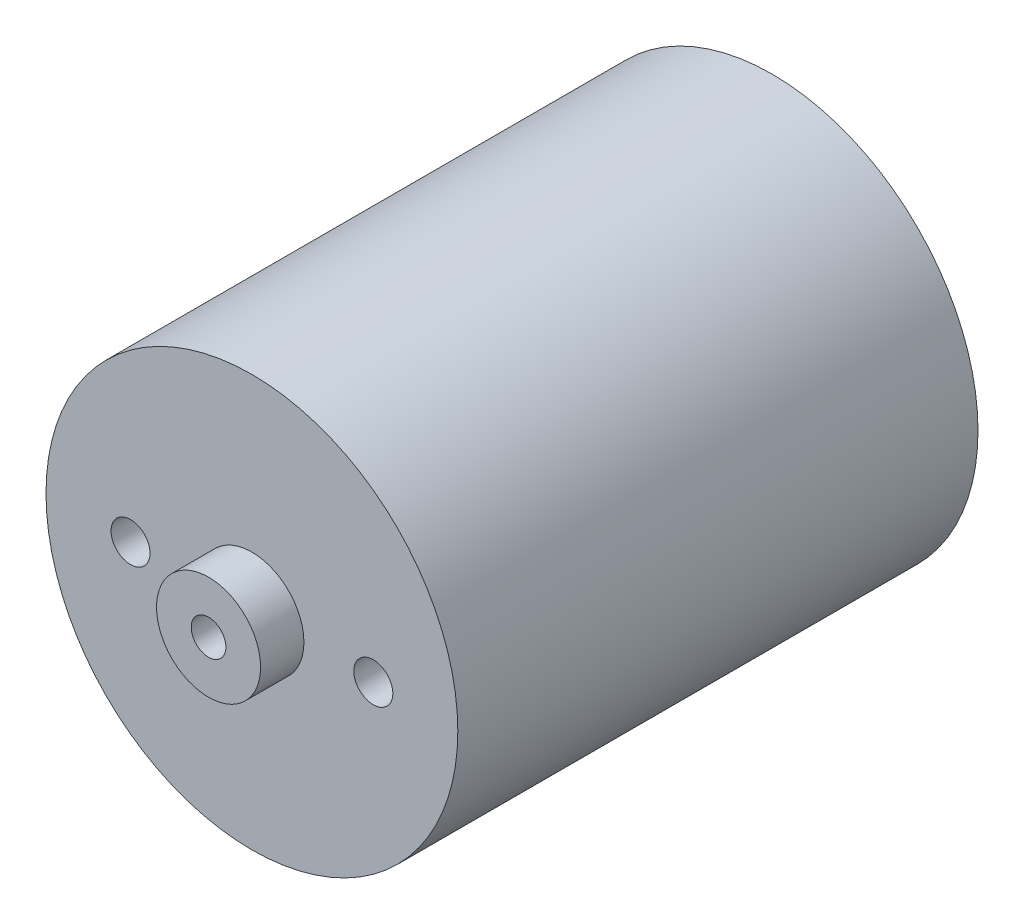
ISO-10303-21;
HEADER;
FILE_DESCRIPTION(('STEP AP214'),'2;1');
FILE_NAME('part.step','',(''),(''),'','','');
FILE_SCHEMA(('AUTOMOTIVE_DESIGN { 1 0 10303 214 1 1 1 1 }'));
ENDSEC;
DATA;
#1=APPLICATION_CONTEXT('core data for automotive mechanical design processes');
#2=APPLICATION_PROTOCOL_DEFINITION('international standard','automotive_design',2000,#1);
#3=PRODUCT_CONTEXT('',#1,'mechanical');
#4=PRODUCT('Part','Part','',(#3));
#5=PRODUCT_RELATED_PRODUCT_CATEGORY('part','',(#4));
#6=PRODUCT_DEFINITION_FORMATION('','',#4);
#7=PRODUCT_DEFINITION_CONTEXT('part definition',#1,'design');
#8=PRODUCT_DEFINITION('design','',#6,#7);
#9=PRODUCT_DEFINITION_SHAPE('','',#8);
#10=(LENGTH_UNIT() NAMED_UNIT(*) SI_UNIT(.MILLI.,.METRE.));
#11=(NAMED_UNIT(*) PLANE_ANGLE_UNIT() SI_UNIT($,.RADIAN.));
#12=(NAMED_UNIT(*) SI_UNIT($,.STERADIAN.) SOLID_ANGLE_UNIT());
#13=UNCERTAINTY_MEASURE_WITH_UNIT(LENGTH_MEASURE(1.E-05),#10,'distance_accuracy_value','');
#14=(GEOMETRIC_REPRESENTATION_CONTEXT(3) GLOBAL_UNCERTAINTY_ASSIGNED_CONTEXT((#13)) GLOBAL_UNIT_ASSIGNED_CONTEXT((#10,
#11,#12)) REPRESENTATION_CONTEXT('',''));
#15=CARTESIAN_POINT('',(0.,0.,0.));
#16=DIRECTION('',(0.,0.,1.));
#17=DIRECTION('',(1.,0.,0.));
#18=AXIS2_PLACEMENT_3D('',#15,#16,#17);
#19=CARTESIAN_POINT('',(0.,0.,-30.48));
#20=DIRECTION('',(0.,0.,1.));
#21=DIRECTION('',(1.,0.,0.));
#22=AXIS2_PLACEMENT_3D('',#19,#20,#21);
#23=CYLINDRICAL_SURFACE('',#22,12.065);
#24=CARTESIAN_POINT('',(0.,0.,-30.48));
#25=DIRECTION('',(0.,0.,1.));
#26=DIRECTION('',(1.,0.,0.));
#27=AXIS2_PLACEMENT_3D('',#24,#25,#26);
#28=CIRCLE('',#27,12.065);
#29=CARTESIAN_POINT('',(12.065,0.,-30.48));
#30=VERTEX_POINT('',#29);
#31=EDGE_CURVE('E38',#30,#30,#28,.T.);
#32=CARTESIAN_POINT('',(0.,0.,0.));
#33=DIRECTION('',(0.,0.,1.));
#34=DIRECTION('',(1.,0.,0.));
#35=AXIS2_PLACEMENT_3D('',#32,#33,#34);
#36=CIRCLE('',#35,12.065);
#37=CARTESIAN_POINT('',(12.065,0.,0.));
#38=VERTEX_POINT('',#37);
#39=EDGE_CURVE('E34',#38,#38,#36,.T.);
#40=CARTESIAN_POINT('',(12.065,0.,-30.48));
#41=CARTESIAN_POINT('',(12.065,0.,-30.1625));
#42=CARTESIAN_POINT('',(12.065,0.,-29.845));
#43=CARTESIAN_POINT('',(12.065,0.,-29.21));
#44=CARTESIAN_POINT('',(12.065,0.,-28.8925));
#45=CARTESIAN_POINT('',(12.065,0.,-28.2575));
#46=CARTESIAN_POINT('',(12.065,0.,-27.94));
#47=CARTESIAN_POINT('',(12.065,0.,-27.305));
#48=CARTESIAN_POINT('',(12.065,0.,-26.9875));
#49=CARTESIAN_POINT('',(12.065,0.,-26.3525));
#50=CARTESIAN_POINT('',(12.065,0.,-26.035));
#51=CARTESIAN_POINT('',(12.065,0.,-25.4));
#52=CARTESIAN_POINT('',(12.065,0.,-25.0825));
#53=CARTESIAN_POINT('',(12.065,0.,-24.4475));
#54=CARTESIAN_POINT('',(12.065,0.,-24.13));
#55=CARTESIAN_POINT('',(12.065,0.,-23.495));
#56=CARTESIAN_POINT('',(12.065,0.,-23.1775));
#57=CARTESIAN_POINT('',(12.065,0.,-22.5425));
#58=CARTESIAN_POINT('',(12.065,0.,-22.225));
#59=CARTESIAN_POINT('',(12.065,0.,-21.59));
#60=CARTESIAN_POINT('',(12.065,0.,-21.2725));
#61=CARTESIAN_POINT('',(12.065,0.,-20.6375));
#62=CARTESIAN_POINT('',(12.065,0.,-20.32));
#63=CARTESIAN_POINT('',(12.065,0.,-19.685));
#64=CARTESIAN_POINT('',(12.065,0.,-19.3675));
#65=CARTESIAN_POINT('',(12.065,0.,-18.7325));
#66=CARTESIAN_POINT('',(12.065,0.,-18.415));
#67=CARTESIAN_POINT('',(12.065,0.,-17.78));
#68=CARTESIAN_POINT('',(12.065,0.,-17.4625));
#69=CARTESIAN_POINT('',(12.065,0.,-16.8275));
#70=CARTESIAN_POINT('',(12.065,0.,-16.51));
#71=CARTESIAN_POINT('',(12.065,0.,-15.875));
#72=CARTESIAN_POINT('',(12.065,0.,-15.5575));
#73=CARTESIAN_POINT('',(12.065,0.,-14.9225));
#74=CARTESIAN_POINT('',(12.065,0.,-14.605));
#75=CARTESIAN_POINT('',(12.065,0.,-13.97));
#76=CARTESIAN_POINT('',(12.065,0.,-13.6525));
#77=CARTESIAN_POINT('',(12.065,0.,-13.0175));
#78=CARTESIAN_POINT('',(12.065,0.,-12.7));
#79=CARTESIAN_POINT('',(12.065,0.,-12.065));
#80=CARTESIAN_POINT('',(12.065,0.,-11.7475));
#81=CARTESIAN_POINT('',(12.065,0.,-11.1125));
#82=CARTESIAN_POINT('',(12.065,0.,-10.795));
#83=CARTESIAN_POINT('',(12.065,0.,-10.16));
#84=CARTESIAN_POINT('',(12.065,0.,-9.8425));
#85=CARTESIAN_POINT('',(12.065,0.,-9.2075));
#86=CARTESIAN_POINT('',(12.065,0.,-8.89));
#87=CARTESIAN_POINT('',(12.065,0.,-8.255));
#88=CARTESIAN_POINT('',(12.065,0.,-7.9375));
#89=CARTESIAN_POINT('',(12.065,0.,-7.3025));
#90=CARTESIAN_POINT('',(12.065,0.,-6.985));
#91=CARTESIAN_POINT('',(12.065,0.,-6.35));
#92=CARTESIAN_POINT('',(12.065,0.,-6.0325));
#93=CARTESIAN_POINT('',(12.065,0.,-5.3975));
#94=CARTESIAN_POINT('',(12.065,0.,-5.08));
#95=CARTESIAN_POINT('',(12.065,0.,-4.445));
#96=CARTESIAN_POINT('',(12.065,0.,-4.1275));
#97=CARTESIAN_POINT('',(12.065,0.,-3.4925));
#98=CARTESIAN_POINT('',(12.065,0.,-3.175));
#99=CARTESIAN_POINT('',(12.065,0.,-2.54));
#100=CARTESIAN_POINT('',(12.065,0.,-2.2225));
#101=CARTESIAN_POINT('',(12.065,0.,-1.5875));
#102=CARTESIAN_POINT('',(12.065,0.,-1.27));
#103=CARTESIAN_POINT('',(12.065,0.,-0.634999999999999));
#104=CARTESIAN_POINT('',(12.065,0.,-0.3175));
#105=CARTESIAN_POINT('',(12.065,0.,0.));
#106=B_SPLINE_CURVE_WITH_KNOTS('',3,(#40,#41,#42,#43,#44,#45,#46,#47,#48,#49,#50,#51,#52,#53,
#54,#55,#56,#57,#58,#59,#60,#61,#62,#63,#64,#65,#66,#67,#68,#69,#70,#71,#72,#73,#74,#75,#76,#77,
#78,#79,#80,#81,#82,#83,#84,#85,#86,#87,#88,#89,#90,#91,#92,#93,#94,#95,#96,#97,#98,#99,#100,
#101,#102,#103,#104,#105),.UNSPECIFIED.,.F.,.F.,(4,2,2,2,2,2,2,2,2,2,2,2,2,2,2,2,2,2,2,2,2,2,2,
2,2,2,2,2,2,2,2,2,4),(0.,0.952500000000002,1.905,2.8575,3.81,4.7625,5.715,6.6675,7.62,8.5725,
9.525,10.4775,11.43,12.3825,13.335,14.2875,15.24,16.1925,17.145,18.0975,19.05,20.0025,20.955,
21.9075,22.86,23.8125,24.765,25.7175,26.67,27.6225,28.575,29.5275,30.48),.UNSPECIFIED.);
#107=EDGE_CURVE('BSEAM31',#30,#38,#106,.T.);
#108=ORIENTED_EDGE('',*,*,#31,.T.);
#109=ORIENTED_EDGE('',*,*,#39,.F.);
#110=ORIENTED_EDGE('',*,*,#107,.T.);
#111=ORIENTED_EDGE('',*,*,#107,.F.);
#112=EDGE_LOOP('',(#108,#110,#109,#111));
#113=FACE_BOUND('',#112,.T.);
#114=ADVANCED_FACE('F31',(#113),#23,.T.);
#115=CARTESIAN_POINT('',(0.,0.,-30.48));
#116=DIRECTION('',(0.,0.,1.));
#117=DIRECTION('',(1.,0.,0.));
#118=AXIS2_PLACEMENT_3D('',#115,#116,#117);
#119=PLANE('',#118);
#120=CARTESIAN_POINT('',(0.,0.,-30.48));
#121=DIRECTION('',(0.,0.,1.));
#122=DIRECTION('',(1.,0.,0.));
#123=AXIS2_PLACEMENT_3D('',#120,#121,#122);
#124=CIRCLE('',#123,1.016);
#125=CARTESIAN_POINT('',(1.016,0.,-30.48));
#126=VERTEX_POINT('',#125);
#127=EDGE_CURVE('E52',#126,#126,#124,.T.);
#128=ORIENTED_EDGE('',*,*,#127,.T.);
#129=EDGE_LOOP('',(#128));
#130=FACE_BOUND('',#129,.T.);
#131=ORIENTED_EDGE('',*,*,#31,.F.);
#132=EDGE_LOOP('',(#131));
#133=FACE_BOUND('',#132,.T.);
#134=ADVANCED_FACE('F66',(#130,#133),#119,.F.);
#135=CARTESIAN_POINT('',(0.,0.,0.));
#136=DIRECTION('',(0.,0.,1.));
#137=DIRECTION('',(1.,0.,0.));
#138=AXIS2_PLACEMENT_3D('',#135,#136,#137);
#139=PLANE('',#138);
#140=CARTESIAN_POINT('',(-7.112,0.,0.));
#141=DIRECTION('',(0.,0.,1.));
#142=DIRECTION('',(1.,0.,0.));
#143=AXIS2_PLACEMENT_3D('',#140,#141,#142);
#144=CIRCLE('',#143,1.143);
#145=CARTESIAN_POINT('',(-5.969,0.,0.));
#146=VERTEX_POINT('',#145);
#147=EDGE_CURVE('E55',#146,#146,#144,.T.);
#148=ORIENTED_EDGE('',*,*,#147,.F.);
#149=EDGE_LOOP('',(#148));
#150=FACE_BOUND('',#149,.T.);
#151=CARTESIAN_POINT('',(7.112,0.,0.));
#152=DIRECTION('',(0.,0.,1.));
#153=DIRECTION('',(-1.,0.,0.));
#154=AXIS2_PLACEMENT_3D('',#151,#152,#153);
#155=CIRCLE('',#154,1.143);
#156=CARTESIAN_POINT('',(5.969,0.,0.));
#157=VERTEX_POINT('',#156);
#158=EDGE_CURVE('E48',#157,#157,#155,.T.);
#159=ORIENTED_EDGE('',*,*,#158,.F.);
#160=EDGE_LOOP('',(#159));
#161=FACE_BOUND('',#160,.T.);
#162=CARTESIAN_POINT('',(0.,0.,0.));
#163=DIRECTION('',(0.,0.,1.));
#164=DIRECTION('',(1.,0.,0.));
#165=AXIS2_PLACEMENT_3D('',#162,#163,#164);
#166=CIRCLE('',#165,3.048);
#167=CARTESIAN_POINT('',(3.048,0.,0.));
#168=VERTEX_POINT('',#167);
#169=EDGE_CURVE('E10',#168,#168,#166,.T.);
#170=ORIENTED_EDGE('',*,*,#169,.F.);
#171=EDGE_LOOP('',(#170));
#172=FACE_BOUND('',#171,.T.);
#173=ORIENTED_EDGE('',*,*,#39,.T.);
#174=EDGE_LOOP('',(#173));
#175=FACE_BOUND('',#174,.T.);
#176=ADVANCED_FACE('F85',(#150,#161,#172,#175),#139,.T.);
#177=CARTESIAN_POINT('',(0.,0.,2.54));
#178=DIRECTION('',(0.,0.,-1.));
#179=DIRECTION('',(-1.,0.,0.));
#180=AXIS2_PLACEMENT_3D('',#177,#178,#179);
#181=CYLINDRICAL_SURFACE('',#180,3.048);
#182=CARTESIAN_POINT('',(0.,0.,2.54));
#183=DIRECTION('',(0.,0.,1.));
#184=DIRECTION('',(1.,0.,0.));
#185=AXIS2_PLACEMENT_3D('',#182,#183,#184);
#186=CIRCLE('',#185,3.048);
#187=CARTESIAN_POINT('',(3.048,0.,2.54));
#188=VERTEX_POINT('',#187);
#189=EDGE_CURVE('E44',#188,#188,#186,.T.);
#190=ORIENTED_EDGE('',*,*,#189,.F.);
#191=EDGE_LOOP('',(#190));
#192=FACE_BOUND('',#191,.T.);
#193=ORIENTED_EDGE('',*,*,#169,.T.);
#194=EDGE_LOOP('',(#193));
#195=FACE_BOUND('',#194,.T.);
#196=ADVANCED_FACE('F80',(#192,#195),#181,.T.);
#197=CARTESIAN_POINT('',(0.,0.,2.54));
#198=DIRECTION('',(0.,0.,1.));
#199=DIRECTION('',(1.,0.,0.));
#200=AXIS2_PLACEMENT_3D('',#197,#198,#199);
#201=PLANE('',#200);
#202=CARTESIAN_POINT('',(0.,0.,2.54));
#203=DIRECTION('',(0.,0.,1.));
#204=DIRECTION('',(1.,0.,0.));
#205=AXIS2_PLACEMENT_3D('',#202,#203,#204);
#206=CIRCLE('',#205,1.016);
#207=CARTESIAN_POINT('',(1.016,0.,2.54));
#208=VERTEX_POINT('',#207);
#209=EDGE_CURVE('E60',#208,#208,#206,.T.);
#210=ORIENTED_EDGE('',*,*,#209,.F.);
#211=EDGE_LOOP('',(#210));
#212=FACE_BOUND('',#211,.T.);
#213=ORIENTED_EDGE('',*,*,#189,.T.);
#214=EDGE_LOOP('',(#213));
#215=FACE_BOUND('',#214,.T.);
#216=ADVANCED_FACE('F76',(#212,#215),#201,.T.);
#217=CARTESIAN_POINT('',(7.112,0.,-2.54));
#218=DIRECTION('',(0.,0.,1.));
#219=DIRECTION('',(1.,0.,0.));
#220=AXIS2_PLACEMENT_3D('',#217,#218,#219);
#221=CYLINDRICAL_SURFACE('',#220,1.143);
#222=CARTESIAN_POINT('',(7.112,0.,-2.54));
#223=DIRECTION('',(0.,0.,1.));
#224=DIRECTION('',(-1.,0.,0.));
#225=AXIS2_PLACEMENT_3D('',#222,#223,#224);
#226=CIRCLE('',#225,1.143);
#227=CARTESIAN_POINT('',(5.969,0.,-2.54));
#228=VERTEX_POINT('',#227);
#229=EDGE_CURVE('E51',#228,#228,#226,.T.);
#230=ORIENTED_EDGE('',*,*,#229,.F.);
#231=EDGE_LOOP('',(#230));
#232=FACE_BOUND('',#231,.T.);
#233=ORIENTED_EDGE('',*,*,#158,.T.);
#234=EDGE_LOOP('',(#233));
#235=FACE_BOUND('',#234,.T.);
#236=ADVANCED_FACE('F79',(#232,#235),#221,.F.);
#237=CARTESIAN_POINT('',(7.112,0.,-2.54));
#238=DIRECTION('',(0.,0.,-1.));
#239=DIRECTION('',(-1.,0.,0.));
#240=AXIS2_PLACEMENT_3D('',#237,#238,#239);
#241=PLANE('',#240);
#242=ORIENTED_EDGE('',*,*,#229,.T.);
#243=EDGE_LOOP('',(#242));
#244=FACE_BOUND('',#243,.T.);
#245=ADVANCED_FACE('F129',(#244),#241,.F.);
#246=CARTESIAN_POINT('',(-7.112,0.,-2.54));
#247=DIRECTION('',(0.,0.,1.));
#248=DIRECTION('',(1.,0.,0.));
#249=AXIS2_PLACEMENT_3D('',#246,#247,#248);
#250=CYLINDRICAL_SURFACE('',#249,1.143);
#251=CARTESIAN_POINT('',(-7.112,0.,-2.54));
#252=DIRECTION('',(0.,0.,1.));
#253=DIRECTION('',(1.,0.,0.));
#254=AXIS2_PLACEMENT_3D('',#251,#252,#253);
#255=CIRCLE('',#254,1.143);
#256=CARTESIAN_POINT('',(-5.969,0.,-2.54));
#257=VERTEX_POINT('',#256);
#258=EDGE_CURVE('E47',#257,#257,#255,.T.);
#259=ORIENTED_EDGE('',*,*,#258,.F.);
#260=EDGE_LOOP('',(#259));
#261=FACE_BOUND('',#260,.T.);
#262=ORIENTED_EDGE('',*,*,#147,.T.);
#263=EDGE_LOOP('',(#262));
#264=FACE_BOUND('',#263,.T.);
#265=ADVANCED_FACE('F124',(#261,#264),#250,.F.);
#266=CARTESIAN_POINT('',(-7.112,0.,-2.54));
#267=DIRECTION('',(0.,0.,1.));
#268=DIRECTION('',(1.,0.,0.));
#269=AXIS2_PLACEMENT_3D('',#266,#267,#268);
#270=PLANE('',#269);
#271=ORIENTED_EDGE('',*,*,#258,.T.);
#272=EDGE_LOOP('',(#271));
#273=FACE_BOUND('',#272,.T.);
#274=ADVANCED_FACE('F72',(#273),#270,.T.);
#275=CARTESIAN_POINT('',(0.,0.,-30.48));
#276=DIRECTION('',(0.,0.,1.));
#277=DIRECTION('',(1.,0.,0.));
#278=AXIS2_PLACEMENT_3D('',#275,#276,#277);
#279=CYLINDRICAL_SURFACE('',#278,1.016);
#280=ORIENTED_EDGE('',*,*,#127,.F.);
#281=EDGE_LOOP('',(#280));
#282=FACE_BOUND('',#281,.T.);
#283=ORIENTED_EDGE('',*,*,#209,.T.);
#284=EDGE_LOOP('',(#283));
#285=FACE_BOUND('',#284,.T.);
#286=ADVANCED_FACE('F69',(#282,#285),#279,.F.);
#287=CLOSED_SHELL('',(#114,#134,#176,#196,#216,#236,#245,#265,#274,#286));
#288=MANIFOLD_SOLID_BREP('B2',#287);
#289=ADVANCED_BREP_SHAPE_REPRESENTATION('',(#18,#288),#14);
#290=SHAPE_DEFINITION_REPRESENTATION(#9,#289);
ENDSEC;
END-ISO-10303-21;
